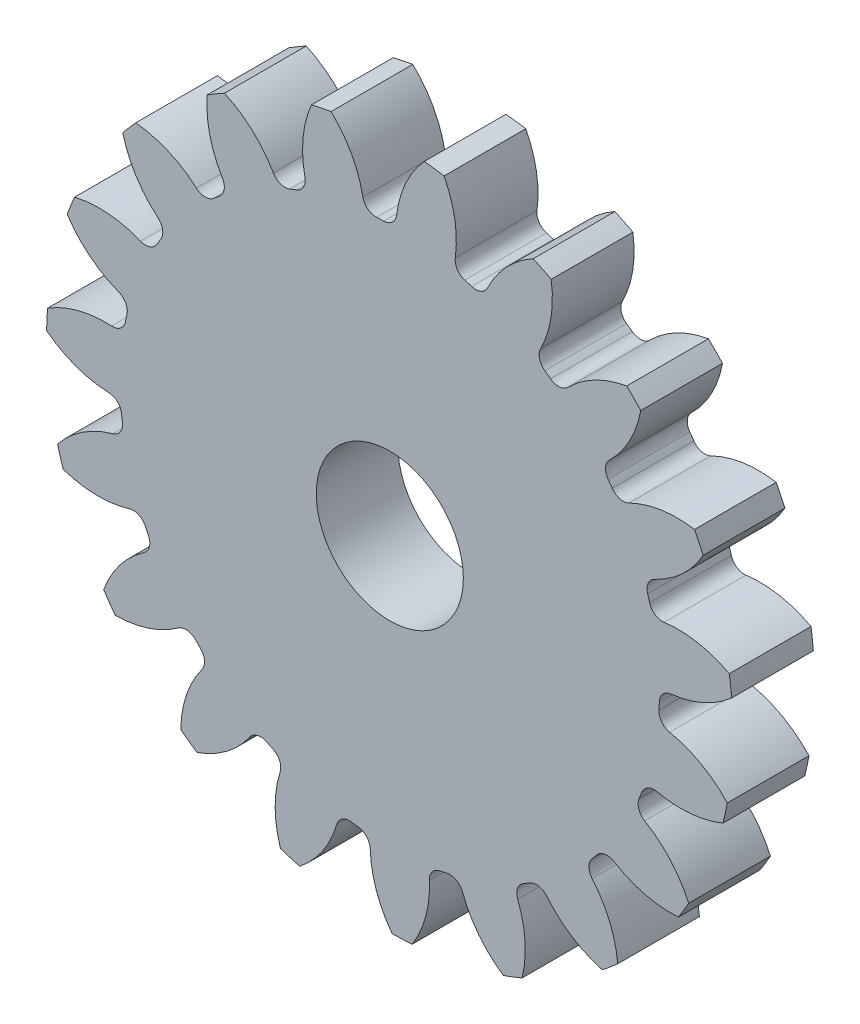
from build123d import *

# Parameters (mm, degrees)
SKETCH3_R         = 533.4
GEARBODY_DEPTH    = 127
TOOTHCUT_DEPTH    = 765.957593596
CIRPATTERN1_COUNT = 19
BOREDIA_R         = 114.3
BORE_DEPTH        = 12700


with BuildPart() as part:
    # Sketch3 → gearBody (new body)
    with BuildSketch(Plane.XY):
        Circle(SKETCH3_R)
    extrude(amount=GEARBODY_DEPTH)

    # Sketch2 → toothCut (cut, through all)
    with BuildSketch(Plane.XY):
        with BuildLine():
            ThreePointArc((418.34058771, -25.218300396), (418.638082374, -19.67145105), (418.862033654, -14.121145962))
            ThreePointArc((418.862033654, -14.121145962), (424.36840662, -0.756103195), (437.283478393, 5.735848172))
            ThreePointArc((437.283478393, 5.735848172), (488.846692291, 19.87944407), (533.4, 49.439706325))
            ThreePointArc((533.4, 49.439706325), (535.09591531, -25.143706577), (526.41369117, -99.239459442))
            ThreePointArc((526.41369117, -99.239459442), (484.828599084, -65.631626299), (434.81884769, -46.715202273))
            ThreePointArc((434.81884769, -46.715202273), (422.569441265, -39.040793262), (418.34058771, -25.218300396))
        make_face()
    toothcut = extrude(amount=TOOTHCUT_DEPTH, mode=Mode.SUBTRACT)

    # CirPattern1: toothCut ×19 about axis
    cirpattern1_axis = Axis((0, 0, 0), (0, 0, 1))
    for i in range(1, CIRPATTERN1_COUNT):
        add(toothcut.rotate(cirpattern1_axis, i * 360 / CIRPATTERN1_COUNT), mode=Mode.SUBTRACT)

    # boreDia → bore (cut, symmetric)
    with BuildSketch(Plane.XY):
        Circle(BOREDIA_R)
    extrude(amount=BORE_DEPTH, both=True, mode=Mode.SUBTRACT)


solid = part.part
